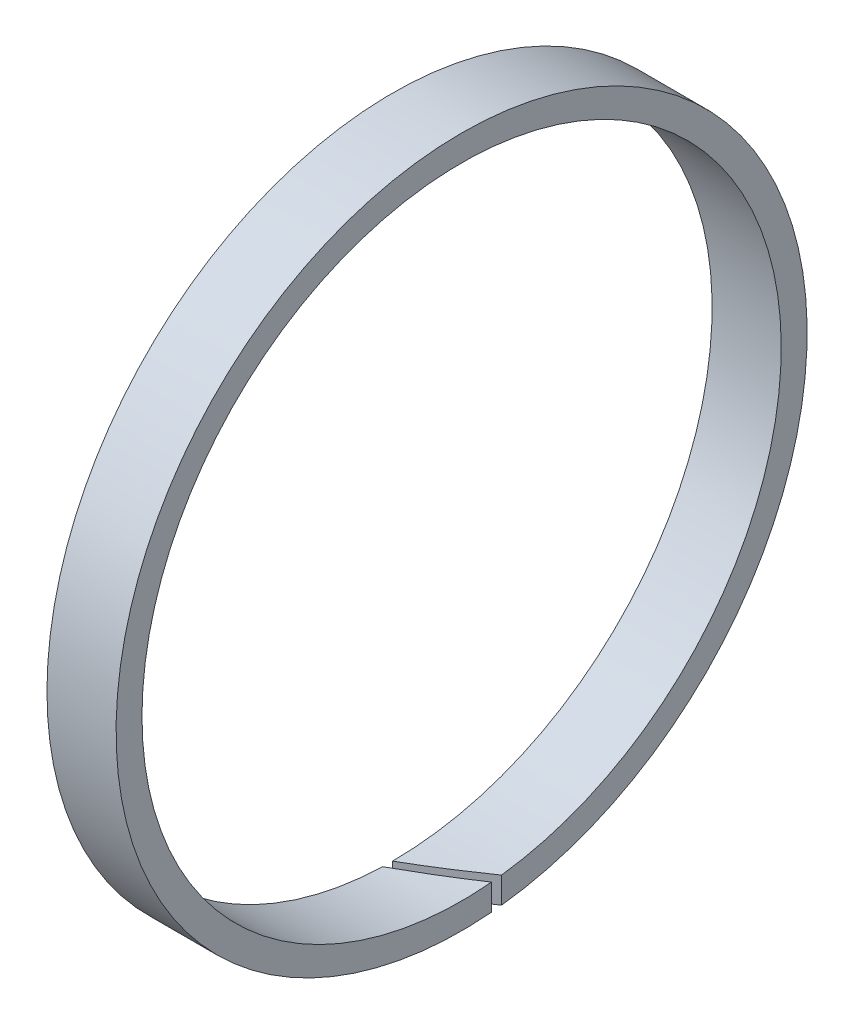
from build123d import *

# Parameters (mm, degrees)
ESQUISSE1_W             = 4
ESQUISSE1_H             = 1.5
ENL_V_MAT_EXTRU_1_DEPTH = 29.565713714


with BuildPart() as part:
    # Esquisse1 → R_volution1 (revolve)
    with BuildSketch(Plane.XY, mode=Mode.PRIVATE) as r_volution1_sk:
        with Locations((2, 19.25)):
            Rectangle(ESQUISSE1_W, ESQUISSE1_H)
    revolve(r_volution1_sk.sketch.rotate(Axis((0, 0, 0), (1, 0, 0)), 90), axis=Axis((0, 0, 0), (1, 0, 0)))

    # Esquisse2 → Enl_v. mat.-Extru.1 (cut, through all)
    with BuildSketch(Plane(origin=(0, 0, 0), x_dir=(1, 0, 0), z_dir=(0, 1, 0))):
        Polygon((0, 0), (4, 2.309401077), (4, 1.732050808), (0, -0.577350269), align=None)
    extrude(amount=-ENL_V_MAT_EXTRU_1_DEPTH, mode=Mode.SUBTRACT)


solid = part.part
